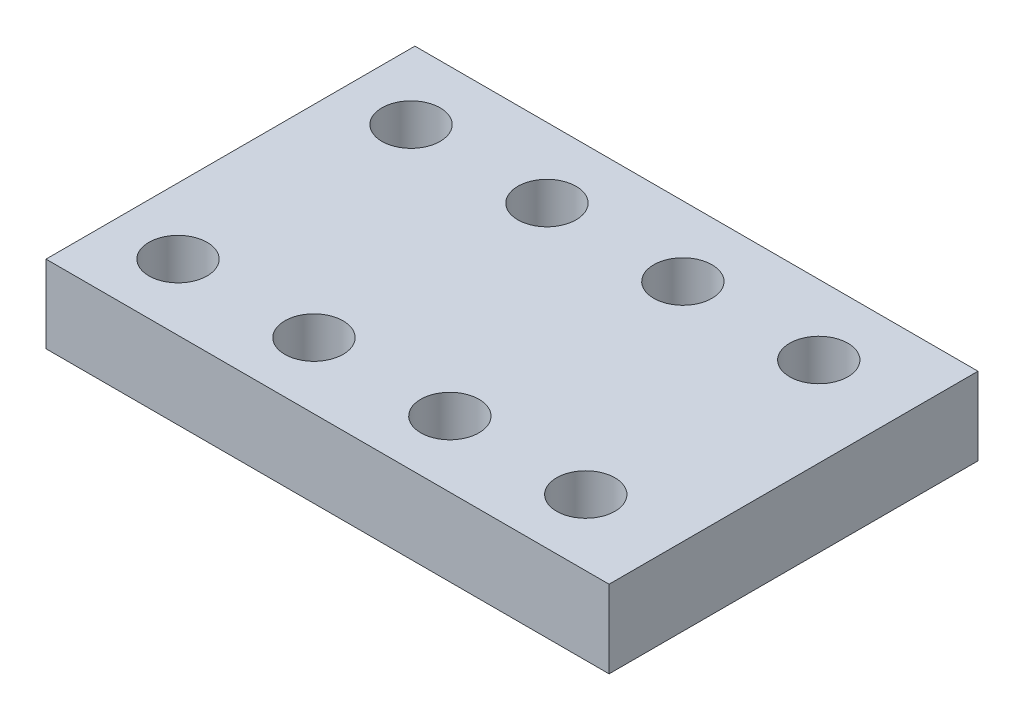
from build123d import *

# Parameters (mm, degrees)
SKETCH1_W            = 145
SKETCH1_H            = 95
EXTRUDE1_DEPTH       = 20
SKETCH2_R            = 7.5
CUT_EXTRUDE2_DEPTH   = 89.952234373
LPATTERN2_COUNT      = 4
LPATTERN2_PITCH      = 35
LPATTERN2_COUNT_DIR2 = 2
LPATTERN2_PITCH_DIR2 = 60


with BuildPart() as part:
    # Sketch1 → Extrude1 (new body)
    with BuildSketch(Plane(origin=(0, 0, 0), x_dir=(1, 0, 0), z_dir=(0, 1, 0))):
        Rectangle(SKETCH1_W, SKETCH1_H)
    extrude(amount=EXTRUDE1_DEPTH)

    # Sketch2 → Cut-Extrude2 (cut, through all)
    with BuildSketch(Plane(origin=(0, 20, 0), x_dir=(-1, 0, 0), z_dir=(0, 1, 0))):
        with Locations(Location((55.5, 30.5, 0), (0, 0, 90))):
            Circle(SKETCH2_R)
    cut_extrude2 = extrude(amount=-CUT_EXTRUDE2_DEPTH, mode=Mode.SUBTRACT)

    # LPattern2: Cut-Extrude2 4 × 2
    with Locations(*[(i * LPATTERN2_PITCH, 0, -j * LPATTERN2_PITCH_DIR2) for i in range(LPATTERN2_COUNT) for j in range(LPATTERN2_COUNT_DIR2) if (i, j) != (0, 0)]):
        add(cut_extrude2, mode=Mode.SUBTRACT)


solid = part.part
